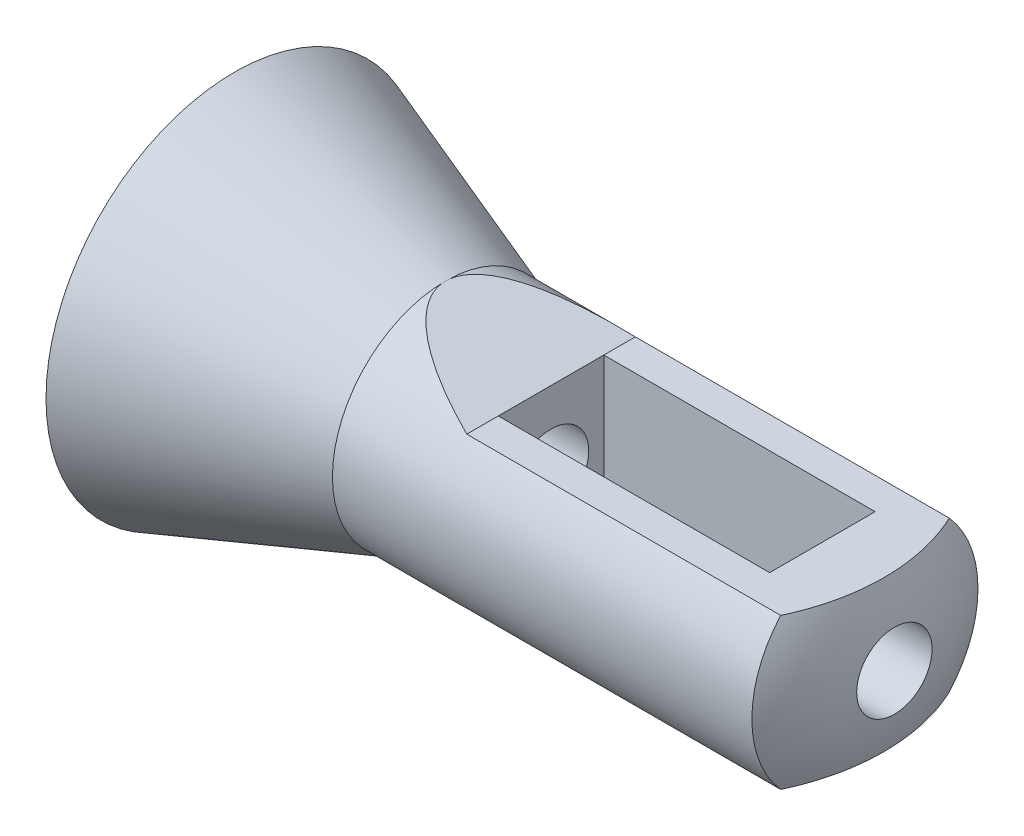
ISO-10303-21;
HEADER;
FILE_DESCRIPTION(('STEP AP214'),'2;1');
FILE_NAME('part.step','',(''),(''),'','','');
FILE_SCHEMA(('AUTOMOTIVE_DESIGN { 1 0 10303 214 1 1 1 1 }'));
ENDSEC;
DATA;
#1=APPLICATION_CONTEXT('core data for automotive mechanical design processes');
#2=APPLICATION_PROTOCOL_DEFINITION('international standard','automotive_design',2000,#1);
#3=PRODUCT_CONTEXT('',#1,'mechanical');
#4=PRODUCT('Part','Part','',(#3));
#5=PRODUCT_RELATED_PRODUCT_CATEGORY('part','',(#4));
#6=PRODUCT_DEFINITION_FORMATION('','',#4);
#7=PRODUCT_DEFINITION_CONTEXT('part definition',#1,'design');
#8=PRODUCT_DEFINITION('design','',#6,#7);
#9=PRODUCT_DEFINITION_SHAPE('','',#8);
#10=(LENGTH_UNIT() NAMED_UNIT(*) SI_UNIT(.MILLI.,.METRE.));
#11=(NAMED_UNIT(*) PLANE_ANGLE_UNIT() SI_UNIT($,.RADIAN.));
#12=(NAMED_UNIT(*) SI_UNIT($,.STERADIAN.) SOLID_ANGLE_UNIT());
#13=UNCERTAINTY_MEASURE_WITH_UNIT(LENGTH_MEASURE(1.E-05),#10,'distance_accuracy_value','');
#14=(GEOMETRIC_REPRESENTATION_CONTEXT(3) GLOBAL_UNCERTAINTY_ASSIGNED_CONTEXT((#13)) GLOBAL_UNIT_ASSIGNED_CONTEXT((#10,
#11,#12)) REPRESENTATION_CONTEXT('',''));
#15=CARTESIAN_POINT('',(0.,0.,0.));
#16=DIRECTION('',(0.,0.,1.));
#17=DIRECTION('',(1.,0.,0.));
#18=AXIS2_PLACEMENT_3D('',#15,#16,#17);
#19=CARTESIAN_POINT('',(95.25,0.,0.));
#20=DIRECTION('',(-1.,0.,0.));
#21=DIRECTION('',(0.,0.,-1.));
#22=AXIS2_PLACEMENT_3D('',#19,#20,#21);
#23=SPHERICAL_SURFACE('',#22,44.45);
#24=CARTESIAN_POINT('',(95.25,-15.875,0.));
#25=DIRECTION('',(0.,1.,0.));
#26=DIRECTION('',(0.,0.,1.));
#27=AXIS2_PLACEMENT_3D('',#24,#25,#26);
#28=CIRCLE('',#27,41.5185124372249);
#29=CARTESIAN_POINT('',(132.78354957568,-15.875,17.7487895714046));
#30=VERTEX_POINT('',#29);
#31=CARTESIAN_POINT('',(132.78354957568,-15.875,-17.7487895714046));
#32=VERTEX_POINT('',#31);
#33=EDGE_CURVE('E169',#30,#32,#28,.T.);
#34=ORIENTED_EDGE('',*,*,#33,.T.);
#35=CARTESIAN_POINT('',(132.78354957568,0.,0.));
#36=DIRECTION('',(-1.,0.,0.));
#37=DIRECTION('',(0.,0.,1.));
#38=AXIS2_PLACEMENT_3D('',#35,#36,#37);
#39=CIRCLE('',#38,23.8125);
#40=CARTESIAN_POINT('',(132.78354957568,15.875,-17.7487895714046));
#41=VERTEX_POINT('',#40);
#42=EDGE_CURVE('E153',#41,#32,#39,.T.);
#43=ORIENTED_EDGE('',*,*,#42,.F.);
#44=CARTESIAN_POINT('',(95.25,15.875,0.));
#45=DIRECTION('',(0.,1.,0.));
#46=DIRECTION('',(0.,0.,1.));
#47=AXIS2_PLACEMENT_3D('',#44,#45,#46);
#48=CIRCLE('',#47,41.5185124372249);
#49=CARTESIAN_POINT('',(132.78354957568,15.875,17.7487895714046));
#50=VERTEX_POINT('',#49);
#51=EDGE_CURVE('E163',#50,#41,#48,.T.);
#52=ORIENTED_EDGE('',*,*,#51,.F.);
#53=EDGE_CURVE('E152',#30,#50,#39,.T.);
#54=ORIENTED_EDGE('',*,*,#53,.F.);
#55=EDGE_LOOP('',(#34,#43,#52,#54));
#56=FACE_BOUND('',#55,.T.);
#57=CARTESIAN_POINT('',(138.98555297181,0.,0.));
#58=DIRECTION('',(-1.,0.,0.));
#59=DIRECTION('',(0.,0.,1.));
#60=AXIS2_PLACEMENT_3D('',#57,#58,#59);
#61=CIRCLE('',#60,7.9375);
#62=CARTESIAN_POINT('',(138.98555297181,0.,7.9375));
#63=VERTEX_POINT('',#62);
#64=EDGE_CURVE('E214',#63,#63,#61,.T.);
#65=ORIENTED_EDGE('',*,*,#64,.T.);
#66=EDGE_LOOP('',(#65));
#67=FACE_BOUND('',#66,.T.);
#68=ADVANCED_FACE('F28',(#56,#67),#23,.T.);
#69=CARTESIAN_POINT('',(0.,0.,0.));
#70=DIRECTION('',(1.,0.,0.));
#71=DIRECTION('',(0.,0.,-1.));
#72=AXIS2_PLACEMENT_3D('',#69,#70,#71);
#73=PLANE('',#72);
#74=CARTESIAN_POINT('',(0.,0.,0.));
#75=DIRECTION('',(-1.,0.,0.));
#76=DIRECTION('',(0.,0.,1.));
#77=AXIS2_PLACEMENT_3D('',#74,#75,#76);
#78=CIRCLE('',#77,39.6875);
#79=CARTESIAN_POINT('',(0.,0.,39.6875));
#80=VERTEX_POINT('',#79);
#81=EDGE_CURVE('E160',#80,#80,#78,.T.);
#82=ORIENTED_EDGE('',*,*,#81,.T.);
#83=EDGE_LOOP('',(#82));
#84=FACE_BOUND('',#83,.T.);
#85=CARTESIAN_POINT('',(0.,0.,0.));
#86=DIRECTION('',(-1.,0.,0.));
#87=DIRECTION('',(0.,0.,1.));
#88=AXIS2_PLACEMENT_3D('',#85,#86,#87);
#89=CIRCLE('',#88,22.8304399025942);
#90=CARTESIAN_POINT('',(0.,0.,22.8304399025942));
#91=VERTEX_POINT('',#90);
#92=EDGE_CURVE('E220',#91,#91,#89,.T.);
#93=ORIENTED_EDGE('',*,*,#92,.F.);
#94=EDGE_LOOP('',(#93));
#95=FACE_BOUND('',#94,.T.);
#96=ADVANCED_FACE('F30',(#84,#95),#73,.F.);
#97=CARTESIAN_POINT('',(123.825,-39.6875,-11.1125));
#98=DIRECTION('',(1.,0.,0.));
#99=DIRECTION('',(0.,0.,-1.));
#100=AXIS2_PLACEMENT_3D('',#97,#98,#99);
#101=PLANE('',#100);
#102=DIRECTION('',(0.,0.,-1.));
#103=VECTOR('',#102,1.);
#104=CARTESIAN_POINT('',(123.825,15.875,273.624131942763));
#105=LINE('',#104,#103);
#106=CARTESIAN_POINT('',(123.825,15.875,11.1125));
#107=VERTEX_POINT('',#106);
#108=CARTESIAN_POINT('',(123.825,15.875,-11.1125));
#109=VERTEX_POINT('',#108);
#110=EDGE_CURVE('E128',#107,#109,#105,.T.);
#111=ORIENTED_EDGE('',*,*,#110,.T.);
#112=DIRECTION('',(0.,1.,0.));
#113=VECTOR('',#112,1.);
#114=CARTESIAN_POINT('',(123.825,-39.6875,-11.1125));
#115=LINE('',#114,#113);
#116=CARTESIAN_POINT('',(123.825,-15.875,-11.1125));
#117=VERTEX_POINT('',#116);
#118=EDGE_CURVE('E116',#117,#109,#115,.T.);
#119=ORIENTED_EDGE('',*,*,#118,.F.);
#120=DIRECTION('',(0.,0.,-1.));
#121=VECTOR('',#120,1.);
#122=CARTESIAN_POINT('',(123.825,-15.875,246.200743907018));
#123=LINE('',#122,#121);
#124=CARTESIAN_POINT('',(123.825,-15.875,11.1125));
#125=VERTEX_POINT('',#124);
#126=EDGE_CURVE('E37',#125,#117,#123,.T.);
#127=ORIENTED_EDGE('',*,*,#126,.F.);
#128=DIRECTION('',(0.,1.,0.));
#129=VECTOR('',#128,1.);
#130=CARTESIAN_POINT('',(123.825,-39.6875,11.1125));
#131=LINE('',#130,#129);
#132=EDGE_CURVE('E176',#125,#107,#131,.T.);
#133=ORIENTED_EDGE('',*,*,#132,.T.);
#134=EDGE_LOOP('',(#111,#119,#127,#133));
#135=FACE_BOUND('',#134,.T.);
#136=CARTESIAN_POINT('',(123.825,0.,0.));
#137=DIRECTION('',(1.,0.,0.));
#138=DIRECTION('',(0.,0.,-1.));
#139=AXIS2_PLACEMENT_3D('',#136,#137,#138);
#140=CIRCLE('',#139,7.9375);
#141=CARTESIAN_POINT('',(123.825,0.,-7.9375));
#142=VERTEX_POINT('',#141);
#143=EDGE_CURVE('E183',#142,#142,#140,.F.);
#144=ORIENTED_EDGE('',*,*,#143,.F.);
#145=EDGE_LOOP('',(#144));
#146=FACE_BOUND('',#145,.T.);
#147=ADVANCED_FACE('F188',(#135,#146),#101,.F.);
#148=CARTESIAN_POINT('',(66.675,-39.6875,-11.1125));
#149=DIRECTION('',(-1.,0.,0.));
#150=DIRECTION('',(0.,0.,1.));
#151=AXIS2_PLACEMENT_3D('',#148,#149,#150);
#152=PLANE('',#151);
#153=DIRECTION('',(0.,0.,1.));
#154=VECTOR('',#153,1.);
#155=CARTESIAN_POINT('',(66.675,15.875,273.624131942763));
#156=LINE('',#155,#154);
#157=CARTESIAN_POINT('',(66.675,15.875,-11.1125));
#158=VERTEX_POINT('',#157);
#159=CARTESIAN_POINT('',(66.675,15.875,11.1125));
#160=VERTEX_POINT('',#159);
#161=EDGE_CURVE('E115',#158,#160,#156,.T.);
#162=ORIENTED_EDGE('',*,*,#161,.T.);
#163=DIRECTION('',(0.,1.,0.));
#164=VECTOR('',#163,1.);
#165=CARTESIAN_POINT('',(66.675,-39.6875,11.1125));
#166=LINE('',#165,#164);
#167=CARTESIAN_POINT('',(66.675,-15.875,11.1125));
#168=VERTEX_POINT('',#167);
#169=EDGE_CURVE('E44',#168,#160,#166,.T.);
#170=ORIENTED_EDGE('',*,*,#169,.F.);
#171=DIRECTION('',(0.,0.,-1.));
#172=VECTOR('',#171,1.);
#173=CARTESIAN_POINT('',(66.675,-15.875,246.200743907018));
#174=LINE('',#173,#172);
#175=CARTESIAN_POINT('',(66.675,-15.875,-11.1125));
#176=VERTEX_POINT('',#175);
#177=EDGE_CURVE('E96',#168,#176,#174,.T.);
#178=ORIENTED_EDGE('',*,*,#177,.T.);
#179=DIRECTION('',(0.,1.,0.));
#180=VECTOR('',#179,1.);
#181=CARTESIAN_POINT('',(66.675,-39.6875,-11.1125));
#182=LINE('',#181,#180);
#183=EDGE_CURVE('E100',#176,#158,#182,.T.);
#184=ORIENTED_EDGE('',*,*,#183,.T.);
#185=EDGE_LOOP('',(#162,#170,#178,#184));
#186=FACE_BOUND('',#185,.T.);
#187=CARTESIAN_POINT('',(66.675,0.,0.));
#188=DIRECTION('',(-1.,0.,0.));
#189=DIRECTION('',(0.,0.,1.));
#190=AXIS2_PLACEMENT_3D('',#187,#188,#189);
#191=CIRCLE('',#190,7.9375);
#192=CARTESIAN_POINT('',(66.675,0.,7.9375));
#193=VERTEX_POINT('',#192);
#194=EDGE_CURVE('E32',#193,#193,#191,.F.);
#195=ORIENTED_EDGE('',*,*,#194,.F.);
#196=EDGE_LOOP('',(#195));
#197=FACE_BOUND('',#196,.T.);
#198=ADVANCED_FACE('F98',(#186,#197),#152,.F.);
#199=CARTESIAN_POINT('',(0.,0.,0.));
#200=DIRECTION('',(-1.,0.,0.));
#201=DIRECTION('',(0.,0.,1.));
#202=AXIS2_PLACEMENT_3D('',#199,#200,#201);
#203=CYLINDRICAL_SURFACE('',#202,23.8125);
#204=ORIENTED_EDGE('',*,*,#42,.T.);
#205=DIRECTION('',(-1.,0.,0.));
#206=VECTOR('',#205,1.);
#207=CARTESIAN_POINT('',(0.,-15.875,-17.7487895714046));
#208=LINE('',#207,#206);
#209=CARTESIAN_POINT('',(66.675,-15.875,-17.7487895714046));
#210=VERTEX_POINT('',#209);
#211=EDGE_CURVE('E140',#32,#210,#208,.T.);
#212=ORIENTED_EDGE('',*,*,#211,.T.);
#213=CARTESIAN_POINT('',(111.125,0.,0.));
#214=DIRECTION('',(-0.336336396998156,0.941741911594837,0.));
#215=DIRECTION('',(-0.941741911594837,-0.336336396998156,0.));
#216=AXIS2_PLACEMENT_3D('',#213,#214,#215);
#217=ELLIPSE('',#216,70.7996524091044,23.8125);
#218=CARTESIAN_POINT('',(44.45,-23.8125,0.));
#219=VERTEX_POINT('',#218);
#220=EDGE_CURVE('E126',#210,#219,#217,.T.);
#221=ORIENTED_EDGE('',*,*,#220,.T.);
#222=CARTESIAN_POINT('',(44.45,0.,0.));
#223=DIRECTION('',(-1.,0.,0.));
#224=DIRECTION('',(0.,0.,1.));
#225=AXIS2_PLACEMENT_3D('',#222,#223,#224);
#226=CIRCLE('',#225,23.8125);
#227=CARTESIAN_POINT('',(44.45,23.8125,0.));
#228=VERTEX_POINT('',#227);
#229=EDGE_CURVE('E157',#228,#219,#226,.T.);
#230=ORIENTED_EDGE('',*,*,#229,.F.);
#231=CARTESIAN_POINT('',(111.125,0.,0.));
#232=DIRECTION('',(0.336336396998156,0.941741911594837,0.));
#233=DIRECTION('',(-0.941741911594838,0.336336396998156,0.));
#234=AXIS2_PLACEMENT_3D('',#231,#232,#233);
#235=ELLIPSE('',#234,70.7996524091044,23.8125);
#236=CARTESIAN_POINT('',(66.675,15.875,-17.7487895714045));
#237=VERTEX_POINT('',#236);
#238=EDGE_CURVE('E168',#237,#228,#235,.T.);
#239=ORIENTED_EDGE('',*,*,#238,.F.);
#240=DIRECTION('',(-1.,0.,0.));
#241=VECTOR('',#240,1.);
#242=CARTESIAN_POINT('',(0.,15.875,-17.7487895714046));
#243=LINE('',#242,#241);
#244=EDGE_CURVE('E149',#41,#237,#243,.T.);
#245=ORIENTED_EDGE('',*,*,#244,.F.);
#246=EDGE_LOOP('',(#204,#212,#221,#230,#239,#245));
#247=FACE_BOUND('',#246,.T.);
#248=ADVANCED_FACE('F204',(#247),#203,.T.);
#249=EDGE_CURVE('E156',#219,#228,#226,.T.);
#250=ORIENTED_EDGE('',*,*,#249,.F.);
#251=CARTESIAN_POINT('',(66.675,-15.875,17.7487895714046));
#252=VERTEX_POINT('',#251);
#253=EDGE_CURVE('E131',#219,#252,#217,.T.);
#254=ORIENTED_EDGE('',*,*,#253,.T.);
#255=DIRECTION('',(-1.,0.,0.));
#256=VECTOR('',#255,1.);
#257=CARTESIAN_POINT('',(0.,-15.875,17.7487895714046));
#258=LINE('',#257,#256);
#259=EDGE_CURVE('E136',#252,#30,#258,.F.);
#260=ORIENTED_EDGE('',*,*,#259,.T.);
#261=ORIENTED_EDGE('',*,*,#53,.T.);
#262=DIRECTION('',(-1.,0.,0.));
#263=VECTOR('',#262,1.);
#264=CARTESIAN_POINT('',(0.,15.875,17.7487895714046));
#265=LINE('',#264,#263);
#266=CARTESIAN_POINT('',(66.675,15.875,17.7487895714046));
#267=VERTEX_POINT('',#266);
#268=EDGE_CURVE('E146',#267,#50,#265,.F.);
#269=ORIENTED_EDGE('',*,*,#268,.F.);
#270=EDGE_CURVE('E165',#228,#267,#235,.T.);
#271=ORIENTED_EDGE('',*,*,#270,.F.);
#272=EDGE_LOOP('',(#250,#254,#260,#261,#269,#271));
#273=FACE_BOUND('',#272,.T.);
#274=ADVANCED_FACE('F202',(#273),#203,.T.);
#275=CARTESIAN_POINT('',(44.45,0.,0.));
#276=DIRECTION('',(-1.,0.,0.));
#277=DIRECTION('',(0.,0.,1.));
#278=AXIS2_PLACEMENT_3D('',#275,#276,#277);
#279=CONICAL_SURFACE('',#278,23.8125,0.343023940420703);
#280=ORIENTED_EDGE('',*,*,#81,.F.);
#281=EDGE_LOOP('',(#280));
#282=FACE_BOUND('',#281,.T.);
#283=ORIENTED_EDGE('',*,*,#229,.T.);
#284=ORIENTED_EDGE('',*,*,#249,.T.);
#285=EDGE_LOOP('',(#283,#284));
#286=FACE_BOUND('',#285,.T.);
#287=ADVANCED_FACE('F207',(#282,#286),#279,.T.);
#288=CARTESIAN_POINT('',(66.675,15.875,273.624131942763));
#289=DIRECTION('',(0.336336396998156,0.941741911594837,0.));
#290=DIRECTION('',(-0.941741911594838,0.336336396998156,0.));
#291=AXIS2_PLACEMENT_3D('',#288,#289,#290);
#292=PLANE('',#291);
#293=ORIENTED_EDGE('',*,*,#238,.T.);
#294=ORIENTED_EDGE('',*,*,#270,.T.);
#295=DIRECTION('',(0.,0.,-1.));
#296=VECTOR('',#295,1.);
#297=CARTESIAN_POINT('',(66.675,15.875,273.624131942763));
#298=LINE('',#297,#296);
#299=EDGE_CURVE('E143',#267,#160,#298,.T.);
#300=ORIENTED_EDGE('',*,*,#299,.T.);
#301=ORIENTED_EDGE('',*,*,#161,.F.);
#302=EDGE_CURVE('E142',#158,#237,#298,.T.);
#303=ORIENTED_EDGE('',*,*,#302,.T.);
#304=EDGE_LOOP('',(#293,#294,#300,#301,#303));
#305=FACE_BOUND('',#304,.T.);
#306=ADVANCED_FACE('F197',(#305),#292,.T.);
#307=CARTESIAN_POINT('',(66.675,15.875,273.624131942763));
#308=DIRECTION('',(0.,1.,0.));
#309=DIRECTION('',(0.,0.,1.));
#310=AXIS2_PLACEMENT_3D('',#307,#308,#309);
#311=PLANE('',#310);
#312=DIRECTION('',(-1.,0.,0.));
#313=VECTOR('',#312,1.);
#314=CARTESIAN_POINT('',(66.675,15.875,-11.1125));
#315=LINE('',#314,#313);
#316=EDGE_CURVE('E114',#109,#158,#315,.T.);
#317=ORIENTED_EDGE('',*,*,#316,.F.);
#318=ORIENTED_EDGE('',*,*,#110,.F.);
#319=DIRECTION('',(1.,0.,0.));
#320=VECTOR('',#319,1.);
#321=CARTESIAN_POINT('',(66.675,15.875,11.1125));
#322=LINE('',#321,#320);
#323=EDGE_CURVE('E178',#160,#107,#322,.T.);
#324=ORIENTED_EDGE('',*,*,#323,.F.);
#325=ORIENTED_EDGE('',*,*,#299,.F.);
#326=ORIENTED_EDGE('',*,*,#268,.T.);
#327=ORIENTED_EDGE('',*,*,#51,.T.);
#328=ORIENTED_EDGE('',*,*,#244,.T.);
#329=ORIENTED_EDGE('',*,*,#302,.F.);
#330=EDGE_LOOP('',(#317,#318,#324,#325,#326,#327,#328,#329));
#331=FACE_BOUND('',#330,.T.);
#332=ADVANCED_FACE('F191',(#331),#311,.T.);
#333=CARTESIAN_POINT('',(66.675,-15.875,246.200743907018));
#334=DIRECTION('',(0.,1.,0.));
#335=DIRECTION('',(0.,0.,1.));
#336=AXIS2_PLACEMENT_3D('',#333,#334,#335);
#337=PLANE('',#336);
#338=ORIENTED_EDGE('',*,*,#126,.T.);
#339=DIRECTION('',(-1.,0.,0.));
#340=VECTOR('',#339,1.);
#341=CARTESIAN_POINT('',(66.675,-15.875,-11.1125));
#342=LINE('',#341,#340);
#343=EDGE_CURVE('E11',#117,#176,#342,.T.);
#344=ORIENTED_EDGE('',*,*,#343,.T.);
#345=EDGE_CURVE('E107',#176,#210,#174,.T.);
#346=ORIENTED_EDGE('',*,*,#345,.T.);
#347=ORIENTED_EDGE('',*,*,#211,.F.);
#348=ORIENTED_EDGE('',*,*,#33,.F.);
#349=ORIENTED_EDGE('',*,*,#259,.F.);
#350=EDGE_CURVE('E106',#252,#168,#174,.T.);
#351=ORIENTED_EDGE('',*,*,#350,.T.);
#352=DIRECTION('',(1.,0.,0.));
#353=VECTOR('',#352,1.);
#354=CARTESIAN_POINT('',(66.675,-15.875,11.1125));
#355=LINE('',#354,#353);
#356=EDGE_CURVE('E171',#168,#125,#355,.T.);
#357=ORIENTED_EDGE('',*,*,#356,.T.);
#358=EDGE_LOOP('',(#338,#344,#346,#347,#348,#349,#351,#357));
#359=FACE_BOUND('',#358,.T.);
#360=ADVANCED_FACE('F120',(#359),#337,.F.);
#361=CARTESIAN_POINT('',(66.675,-15.875,246.200743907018));
#362=DIRECTION('',(-0.336336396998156,0.941741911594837,0.));
#363=DIRECTION('',(-0.941741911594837,-0.336336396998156,0.));
#364=AXIS2_PLACEMENT_3D('',#361,#362,#363);
#365=PLANE('',#364);
#366=ORIENTED_EDGE('',*,*,#253,.F.);
#367=ORIENTED_EDGE('',*,*,#220,.F.);
#368=ORIENTED_EDGE('',*,*,#345,.F.);
#369=ORIENTED_EDGE('',*,*,#177,.F.);
#370=ORIENTED_EDGE('',*,*,#350,.F.);
#371=EDGE_LOOP('',(#366,#367,#368,#369,#370));
#372=FACE_BOUND('',#371,.T.);
#373=ADVANCED_FACE('F124',(#372),#365,.F.);
#374=CARTESIAN_POINT('',(66.675,-39.6875,-11.1125));
#375=DIRECTION('',(0.,0.,-1.));
#376=DIRECTION('',(-1.,0.,0.));
#377=AXIS2_PLACEMENT_3D('',#374,#375,#376);
#378=PLANE('',#377);
#379=ORIENTED_EDGE('',*,*,#316,.T.);
#380=ORIENTED_EDGE('',*,*,#183,.F.);
#381=ORIENTED_EDGE('',*,*,#343,.F.);
#382=ORIENTED_EDGE('',*,*,#118,.T.);
#383=EDGE_LOOP('',(#379,#380,#381,#382));
#384=FACE_BOUND('',#383,.T.);
#385=ADVANCED_FACE('F110',(#384),#378,.F.);
#386=CARTESIAN_POINT('',(66.675,-39.6875,11.1125));
#387=DIRECTION('',(0.,0.,1.));
#388=DIRECTION('',(1.,0.,0.));
#389=AXIS2_PLACEMENT_3D('',#386,#387,#388);
#390=PLANE('',#389);
#391=ORIENTED_EDGE('',*,*,#323,.T.);
#392=ORIENTED_EDGE('',*,*,#132,.F.);
#393=ORIENTED_EDGE('',*,*,#356,.F.);
#394=ORIENTED_EDGE('',*,*,#169,.T.);
#395=EDGE_LOOP('',(#391,#392,#393,#394));
#396=FACE_BOUND('',#395,.T.);
#397=ADVANCED_FACE('F174',(#396),#390,.F.);
#398=CARTESIAN_POINT('',(0.,0.,0.));
#399=DIRECTION('',(-1.,0.,0.));
#400=DIRECTION('',(0.,0.,1.));
#401=AXIS2_PLACEMENT_3D('',#398,#399,#400);
#402=CYLINDRICAL_SURFACE('',#401,7.9375);
#403=CARTESIAN_POINT('',(41.7002317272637,0.,0.));
#404=DIRECTION('',(-1.,0.,0.));
#405=DIRECTION('',(0.,0.,1.));
#406=AXIS2_PLACEMENT_3D('',#403,#404,#405);
#407=CIRCLE('',#406,7.9375);
#408=CARTESIAN_POINT('',(41.7002317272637,0.,7.9375));
#409=VERTEX_POINT('',#408);
#410=EDGE_CURVE('E216',#409,#409,#407,.T.);
#411=ORIENTED_EDGE('',*,*,#410,.T.);
#412=EDGE_LOOP('',(#411));
#413=FACE_BOUND('',#412,.T.);
#414=ORIENTED_EDGE('',*,*,#194,.T.);
#415=EDGE_LOOP('',(#414));
#416=FACE_BOUND('',#415,.T.);
#417=ADVANCED_FACE('F240',(#413,#416),#402,.F.);
#418=CARTESIAN_POINT('',(41.7002317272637,0.,0.));
#419=DIRECTION('',(-1.,0.,0.));
#420=DIRECTION('',(0.,0.,1.));
#421=AXIS2_PLACEMENT_3D('',#418,#419,#420);
#422=CONICAL_SURFACE('',#421,7.9375,0.343023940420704);
#423=ORIENTED_EDGE('',*,*,#92,.T.);
#424=EDGE_LOOP('',(#423));
#425=FACE_BOUND('',#424,.T.);
#426=ORIENTED_EDGE('',*,*,#410,.F.);
#427=EDGE_LOOP('',(#426));
#428=FACE_BOUND('',#427,.T.);
#429=ADVANCED_FACE('F260',(#425,#428),#422,.F.);
#430=ORIENTED_EDGE('',*,*,#64,.F.);
#431=EDGE_LOOP('',(#430));
#432=FACE_BOUND('',#431,.T.);
#433=ORIENTED_EDGE('',*,*,#143,.T.);
#434=EDGE_LOOP('',(#433));
#435=FACE_BOUND('',#434,.T.);
#436=ADVANCED_FACE('F227',(#432,#435),#402,.F.);
#437=CLOSED_SHELL('',(#68,#96,#147,#198,#248,#274,#287,#306,#332,#360,#373,#385,#397,#417,#429,#436));
#438=MANIFOLD_SOLID_BREP('B2',#437);
#439=ADVANCED_BREP_SHAPE_REPRESENTATION('',(#18,#438),#14);
#440=SHAPE_DEFINITION_REPRESENTATION(#9,#439);
ENDSEC;
END-ISO-10303-21;
